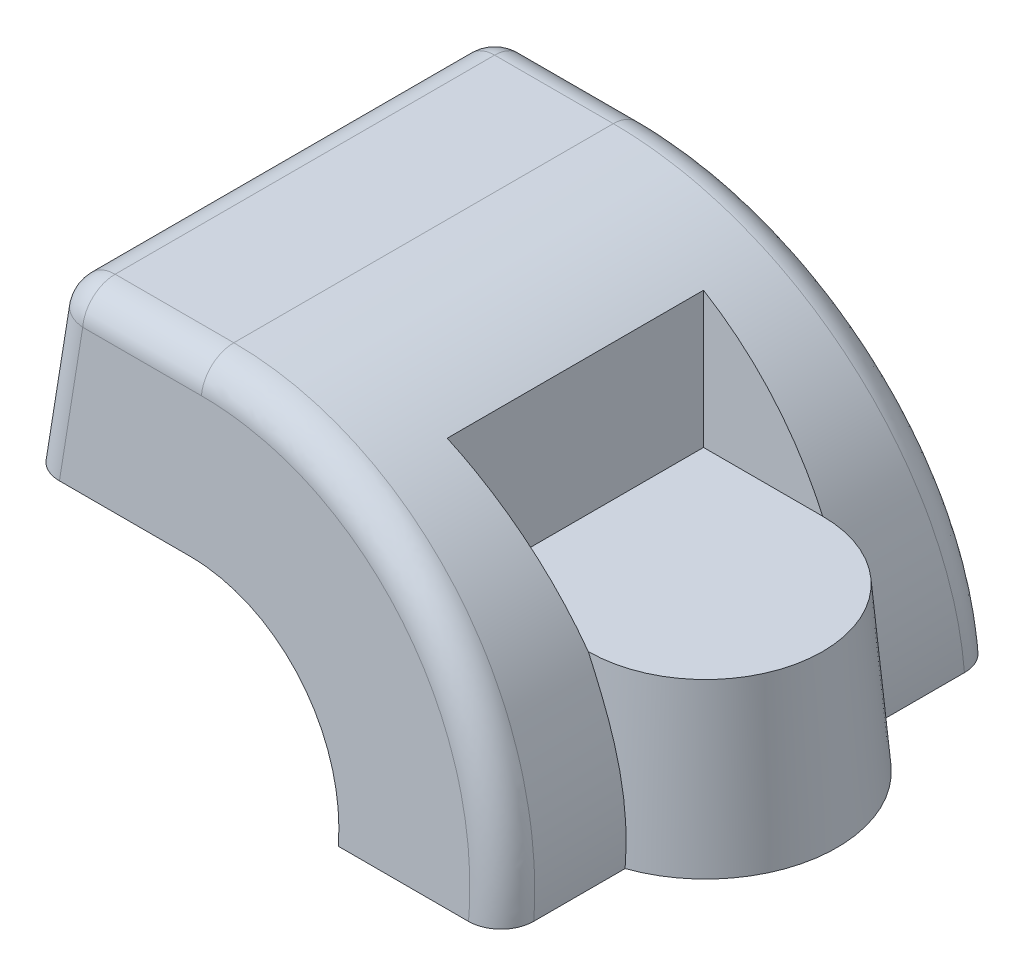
from build123d import *

# Parameters (mm, degrees)
EXTRUDE1_DEPTH = 38.1
DRAFT1_ANGLE   = 5.000000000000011
DRAFT2_ANGLE   = -5.000000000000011
FILLET1_R      = 5
SKETCH2_W      = 34.49999999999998
SKETCH2_H      = 36
POCKET_DEPTH   = 68.65064687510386
POCKET_DRAFT   = 5.000000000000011
BOSS_DEPTH     = 25
BOSS_DRAFT     = 5.000000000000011


with BuildPart() as part:
    # Sketch1 → Extrude1 (new, symmetric)
    with BuildSketch(Plane.XY):
        with BuildLine():
            Line((-25, 25.000000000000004), (0, 24.99999999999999))
            ThreePointArc((0, 24.99999999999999), (17.67766952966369, 17.677669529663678), (25, -1.059e-14))
            Line((25, -1.059e-14), (49.999999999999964, 0))
            ThreePointArc((49.999999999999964, 0), (35.355339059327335, 35.35533905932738), (-4.848e-14, 50.00000000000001))
            Line((-4.848e-14, 50.00000000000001), (-25.000000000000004, 50))
            Line((-25.000000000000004, 50), (-25, 25.000000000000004))
        make_face()
    extrude(amount=EXTRUDE1_DEPTH, both=True)

    # Draft1
    draft1_faces = [part.faces().sort_by_distance(p)[0] for p in [
        (13.656340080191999, 28.554165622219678, -38.1),
        (13.656340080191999, 28.554165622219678, 38.1),
    ]]
    draft(draft1_faces, Plane.ZX, DRAFT1_ANGLE)

    # Draft2
    draft2_faces = [part.faces().sort_by_distance(p)[0] for p in [
        (-25, 37.36913241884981, -7.05e-15),
    ]]
    draft(draft2_faces, Plane(origin=(-25, 25.000000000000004, 38.1), x_dir=(-1, 5.6e-16, 0), z_dir=(-5.6e-16, -1, 0)), DRAFT2_ANGLE)

    # Fillet1
    fillet1_edges = [part.edges().sort_by_distance(p)[0] for p in [
        (-22.812783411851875, 50, 0),
        (35.389021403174, 35.321624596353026, 35.00975827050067),
        (-11.406391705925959, 50.00000000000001, 33.7255668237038),
        (-23.906391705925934, 37.5, 34.81917511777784),
        (-11.406391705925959, 50.00000000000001, -33.7255668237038),
        (35.389021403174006, 35.32162459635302, -35.00975827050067),
        (-23.906391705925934, 37.5, -34.819175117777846),
    ]]
    fillet(fillet1_edges, radius=FILLET1_R)


with BuildPart() as pocket_tool:
    # Sketch2 → Pocket (with draft: the straight prism first)
    with BuildSketch(Plane.XZ.offset(-24.99999999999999)):
        with Locations((42.25, 0)):
            Rectangle(SKETCH2_W, SKETCH2_H)
    extrude(amount=-POCKET_DEPTH)
    # Pocket: the draft: its side faces are tilted about the plane it starts from
    pocket_sides = [pocket_tool.faces().sort_by_distance(p)[0] for p in [
        (25, 59.325323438, 0),
        (42.25, 59.325323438, -18),
        (59.5, 59.325323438, 0),
        (42.25, 59.325323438, 18),
    ]]
    draft(pocket_sides, Plane.XZ.offset(-24.99999999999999), POCKET_DRAFT)


with BuildPart() as part_1:
    add(part.part)

    # Pocket: cut by pocket_tool
    add(pocket_tool.part, mode=Mode.SUBTRACT)


with BuildPart() as boss_tool:
    # Sketch3 → Boss (with draft: the straight prism first)
    with BuildSketch(Plane(origin=(1.508e-14, 24.99999999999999, 0), x_dir=(1, -6e-16, 0), z_dir=(6e-16, 1, 0))):
        with BuildLine():
            Line((43.301270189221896, 18), (43.301270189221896, -18))
            ThreePointArc((43.301270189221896, -18), (61.3012701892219, 0), (43.301270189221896, 18))
        make_face()
    extrude(amount=-BOSS_DEPTH)
    # Boss: the draft: its side faces are tilted about the plane it starts from
    boss_sides = [boss_tool.faces().sort_by_distance(p)[0] for p in [
        (43.301270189, 12.5, 0),
        (61.301270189, 12.5, 0),
    ]]
    draft(boss_sides, Plane(origin=(1.508e-14, 24.99999999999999, 0), x_dir=(1, -6e-16, 0), z_dir=(6e-16, 1, 0)), BOSS_DRAFT)


with BuildPart() as part_2:
    add(part_1.part)

    # Boss: add boss_tool
    add(boss_tool.part)


solid = part_2.part
